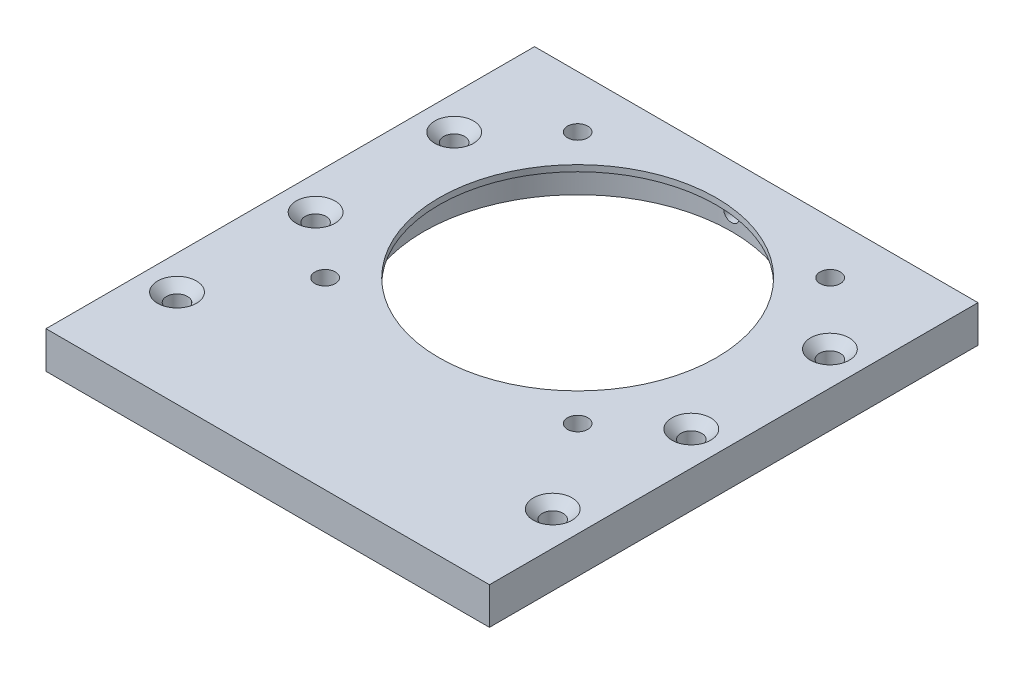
from build123d import *

# Parameters (mm, degrees)
SKETCH1_W                                       = 79.32
SKETCH1_H                                       = 6
BOSS_EXTRUDE1_DEPTH                             = 36
SKETCH2_R                                       = 25
CUT_EXTRUDE1_DEPTH                              = 5
SKETCH3_R                                       = 22.5
CUT_EXTRUDE2_DEPTH                              = 63.073363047
CSK_FOR_M3_FLAT_HEAD_MACHINE_SCREW1_D           = 3.4
CSK_FOR_M3_FLAT_HEAD_MACHINE_SCREW1_CSINK_D     = 6.3
CSK_FOR_M3_FLAT_HEAD_MACHINE_SCREW1_CSINK_ANGLE = 90
M4X0_7_TAPPED_HOLE1_D                           = 3.3
M3X0_5_TAPPED_HOLE1_REACH                       = 89.159
M3X0_5_TAPPED_HOLE1_BORE_R                      = 1.25


with BuildPart() as part:
    # Sketch1 → Boss-Extrude1 (new, symmetric)
    with BuildSketch(Plane(origin=(0, 0, 0), x_dir=(0, 0, -1), z_dir=(1, 0, 0))):
        with Locations((-10.66, 0)):
            Rectangle(SKETCH1_W, SKETCH1_H)
    extrude(amount=BOSS_EXTRUDE1_DEPTH, both=True)

    # Sketch2 → Cut-Extrude1 (cut)
    with BuildSketch(Plane.XZ.offset(3)):
        with Locations(Location((0, 0, 0), (0, 0, 270))):
            Circle(SKETCH2_R)
    extrude(amount=-CUT_EXTRUDE1_DEPTH, mode=Mode.SUBTRACT)

    # Sketch3 → Cut-Extrude2 (cut, through all)
    with BuildSketch(Plane(origin=(0, 2, 0), x_dir=(-1, 0, 0), z_dir=(0, -1, 0))):
        with Locations(Location((0, 0, 0), (0, 0, 90))):
            Circle(SKETCH3_R)
    extrude(amount=-CUT_EXTRUDE2_DEPTH, mode=Mode.SUBTRACT)

    # CSK for M3 Flat Head Machine Screw1 (through all)
    with Locations(Plane(origin=(0, 3, 0), x_dir=(1, 0, 0), z_dir=(0, 1, 0))):
        with Locations((-30.5, -12.047005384), (-30.5, -34.547005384), (30.5, -34.547005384), (30.5, -12.047005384), (-30.5, 10.452994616), (30.5, 10.452994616)):
            CounterSinkHole(CSK_FOR_M3_FLAT_HEAD_MACHINE_SCREW1_D / 2, CSK_FOR_M3_FLAT_HEAD_MACHINE_SCREW1_CSINK_D / 2, counter_sink_angle=CSK_FOR_M3_FLAT_HEAD_MACHINE_SCREW1_CSINK_ANGLE)

    # M4x0.7 Tapped Hole1 (through all)
    with Locations(Plane(origin=(0, -3, 0), x_dir=(-1, 0, 0), z_dir=(0, -1, 0))):
        with Locations((-20.5, -20.5), (20.5, -20.5), (20.5, 20.5), (-20.5, 20.5)):
            Hole(M4X0_7_TAPPED_HOLE1_D / 2)

    # M3x0.5 Tapped Hole1 bore → M3x0.5 Tapped Hole1 (cut, up to next)
    with BuildSketch(Plane(origin=(0, 0, -29), x_dir=(-1, 0, 0), z_dir=(0, 0, -1)), mode=Mode.PRIVATE) as m3x0_5_tapped_hole1_sk1:
        with Locations((0, -0.5)):
            Circle(M3X0_5_TAPPED_HOLE1_BORE_R)
    m3x0_5_tapped_hole1_tool1 = extrude(m3x0_5_tapped_hole1_sk1.sketch, amount=-M3X0_5_TAPPED_HOLE1_REACH, mode=Mode.PRIVATE) & part.part
    add(m3x0_5_tapped_hole1_tool1.solids().sort_by_distance((0, -0.5, -29))[0], mode=Mode.SUBTRACT)


solid = part.part
